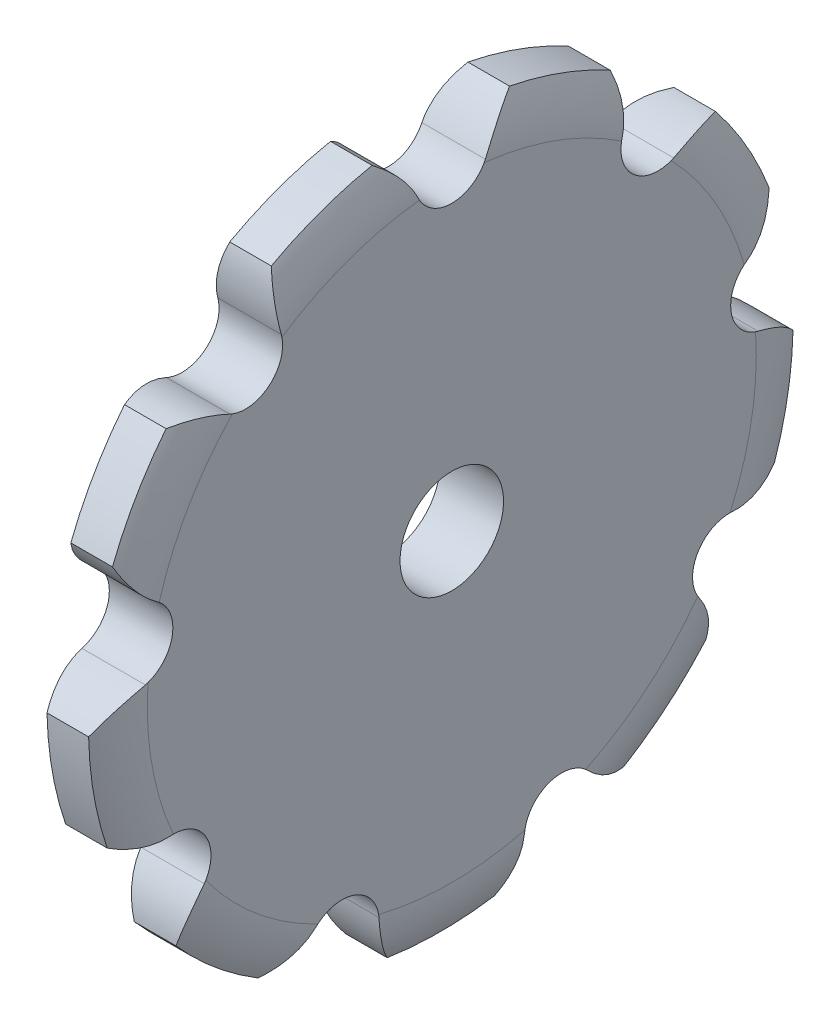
from build123d import *

# Parameters (mm, degrees)
TOOTHCUT_DEPTH  = 59.188528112
TEETHCUTS_COUNT = 9
TEETHCUTS_ANGLE = 320
BORSKE_R        = 6
BORE_DEPTH      = 10.363


with BuildPart() as part:
    # BasProSke → Base-Revolve (revolve)
    with BuildSketch(Plane(origin=(0, 0, 0), x_dir=(1, 0, 0), z_dir=(0, 1, 0)), mode=Mode.PRIVATE) as base_revolve_sk:
        with BuildLine():
            Line((0, 0), (0, 35.279014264))
            ThreePointArc((0, 35.279014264), (0.321571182, 38.118820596), (1.27, 40.814815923))
            Line((1.27, 40.814815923), (6.0925, 40.814815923))
            ThreePointArc((6.0925, 40.814815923), (7.040928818, 38.118820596), (7.3625, 35.279014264))
            Line((7.3625, 35.279014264), (7.3625, 0))
            Line((7.3625, 0), (0, 0))
        make_face()
    revolve(base_revolve_sk.sketch.rotate(Axis((-10, 0, 0), (1, 0, 0)), 180), axis=Axis((-10, 0, 0), (1, 0, 0)))

    # TooCutSke → ToothCut (cut, through all)
    with BuildSketch(Plane(origin=(0, 0, 0), x_dir=(0, 0, -1), z_dir=(1, 0, 0))):
        with BuildLine():
            ThreePointArc((3.89490303, 35.358642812), (5.602226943, 37.985977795), (7.968827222, 40.039522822))
            ThreePointArc((7.968827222, 40.039522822), (0, 40.824815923), (-7.968827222, 40.039522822))
            ThreePointArc((-7.968827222, 40.039522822), (-5.602226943, 37.985977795), (-3.89490303, 35.358642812))
            ThreePointArc((-3.89490303, 35.358642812), (0, 32.877315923), (3.89490303, 35.358642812))
        make_face()
    toothcut = extrude(amount=TOOTHCUT_DEPTH, mode=Mode.SUBTRACT)

    # TeethCuts: ToothCut ×9 about axis
    teethcuts_axis = Axis((-10, 0, 0), (1, 0, 0))
    for i in range(1, TEETHCUTS_COUNT):
        add(toothcut.rotate(teethcuts_axis, i * TEETHCUTS_ANGLE / (TEETHCUTS_COUNT - 1)), mode=Mode.SUBTRACT)

    # BorSke → Bore (cut, symmetric)
    with BuildSketch(Plane(origin=(0, 0, 0), x_dir=(0, 0, -1), z_dir=(1, 0, 0))):
        with Locations(Location((0, 0, 0), (0, 0, 180))):
            Circle(BORSKE_R)
    extrude(amount=BORE_DEPTH, both=True, mode=Mode.SUBTRACT)


solid = part.part
